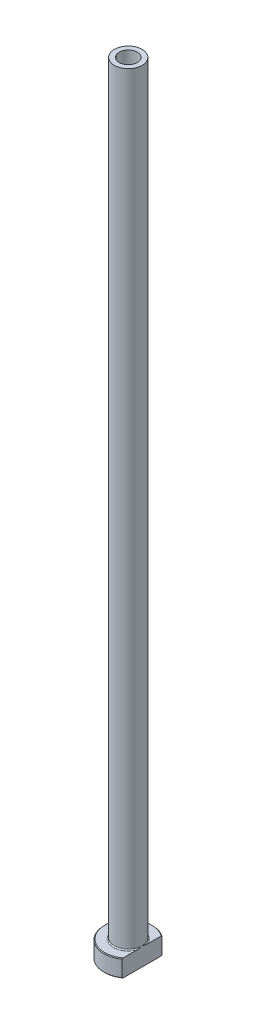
from build123d import *

# Parameters (mm, degrees)
FILLET1_R          = 0.3
CHAMFER1_SIZE      = 0.2
CUT_EXTRUDE1_DEPTH = 226.217672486
CHAMFER2_SIZE      = 0.5


with BuildPart() as part:
    # Sketch1 → Revolve1 (revolve)
    with BuildSketch(Plane.XY, mode=Mode.PRIVATE) as revolve1_sk:
        Polygon((-2.6, 225), (-4, 225), (-4, 5), (-7, 5), (-7, 0), (-2.85, 0), (-2.85, 168), (-2.6, 180), align=None)
    revolve(revolve1_sk.sketch.rotate(Axis((0, 92.187680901, 0), (0, -1, 0)), 270), axis=Axis((0, 92.187680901, 0), (0, -1, 0)))

    # Fillet1
    fillet1_edges = [part.edges().sort_by_distance(p)[0] for p in [
        (0, 5, -4),
    ]]
    fillet(fillet1_edges, radius=FILLET1_R)

    # Chamfer1
    chamfer1_edges = [part.edges().sort_by_distance(p)[0] for p in [
        (0, 0, -7),
        (0, 5, -7),
    ]]
    chamfer(chamfer1_edges, length=CHAMFER1_SIZE)

    # Sketch2 → Cut-Extrude1 (cut, through all)
    with BuildSketch(Plane.XZ):
        with BuildLine():
            Line((4, 5.744562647), (4, -5.744562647))
            ThreePointArc((4, -5.744562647), (7, 0), (4, 5.744562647))
        make_face()
    extrude(amount=-CUT_EXTRUDE1_DEPTH, mode=Mode.SUBTRACT)

    # Chamfer2
    chamfer2_edges = [part.edges().sort_by_distance(p)[0] for p in [
        (0, 0, -2.85),
    ]]
    chamfer(chamfer2_edges, length=CHAMFER2_SIZE)


solid = part.part
